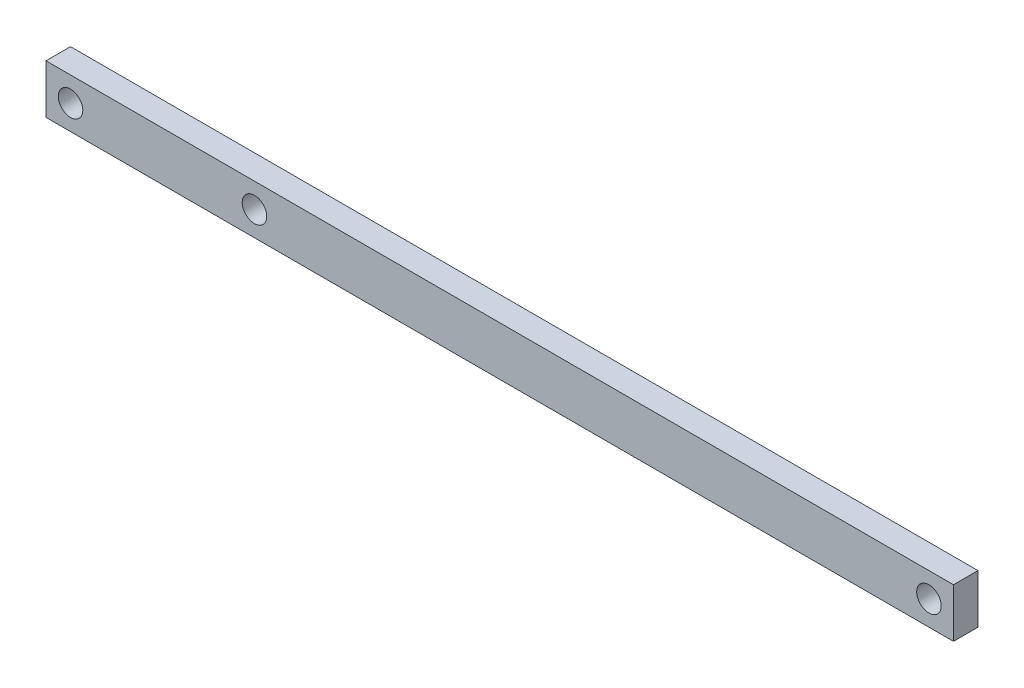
from build123d import *

# Parameters (mm, degrees)
BOSS_EXTRUDE1_DEPTH            = 10
BOSS_EXTRUDE1_DEPTH_BACK       = 10
SKETCH1_W                      = 700
SKETCH1_H                      = 40
SKETCH6_W                      = 20
SKETCH6_H                      = 40
BOSS_EXTRUDE2_DEPTH            = 20
SKETCH7_W                      = 20
SKETCH7_H                      = 40
BOSS_EXTRUDE3_DEPTH            = 20
CUT_EXTRUDE1_REACH             = 372.675
SKETCH2_R                      = 10
CUT_EXTRUDE1_DIRECTION_2_REACH = 372.675
CUT_EXTRUDE3_REACH             = 372.675
SKETCH4_R                      = 10
CUT_EXTRUDE3_DIRECTION_2_REACH = 372.675
CUT_EXTRUDE4_REACH             = 372.675
SKETCH5_R                      = 10
CUT_EXTRUDE4_DIRECTION_2_REACH = 372.675


with BuildPart() as part:
    # Sketch1 → Boss-Extrude1 (new, two sides: drawn at the far end of the back side and taken through both)
    with BuildSketch(Plane.XY.offset(-BOSS_EXTRUDE1_DEPTH_BACK)):
        Rectangle(SKETCH1_W, SKETCH1_H)
    extrude(amount=BOSS_EXTRUDE1_DEPTH + BOSS_EXTRUDE1_DEPTH_BACK)

    # Sketch6 → Boss-Extrude2 (add)
    with BuildSketch(Plane(origin=(350, 0, 0), x_dir=(0, 0, -1), z_dir=(1, 0, 0))):
        Rectangle(SKETCH6_W, SKETCH6_H)
    extrude(amount=BOSS_EXTRUDE2_DEPTH)

    # Sketch7 → Boss-Extrude3 (add)
    with BuildSketch(Plane.ZY.offset(350)):
        Rectangle(SKETCH7_W, SKETCH7_H)
    extrude(amount=BOSS_EXTRUDE3_DEPTH)

    # Cut-Extrude1: up to this face of the body (flat: up to its plane)
    cut_extrude1_end = Plane(part.part.faces().sort_by_distance((0, 0, -10))[0])
    # Sketch2 → Cut-Extrude1 (cut, up to the picked face)
    with BuildSketch(Plane.XY, mode=Mode.PRIVATE) as cut_extrude1_sk1:
        with Locations((350, 0)):
            Circle(SKETCH2_R)
    cut_extrude1_tool1 = split(extrude(cut_extrude1_sk1.sketch, amount=-CUT_EXTRUDE1_REACH, mode=Mode.PRIVATE), bisect_by=cut_extrude1_end, keep=Keep.BOTH, mode=Mode.PRIVATE)
    add(cut_extrude1_tool1.solids().sort_by(Axis((350, 0, 0), (0, 0, -1)))[0], mode=Mode.SUBTRACT)

    # Cut-Extrude1 direction 2: up to this face of the body (flat: up to its plane)
    cut_extrude1_direction_2_end = Plane(part.part.faces().sort_by_distance((0, 0, 10))[0])
    # Sketch2 → Cut-Extrude1 direction 2 (cut, up to the picked face)
    with BuildSketch(Plane.XY, mode=Mode.PRIVATE) as cut_extrude1_direction_2_sk1:
        with Locations((350, 0)):
            Circle(SKETCH2_R)
    cut_extrude1_direction_2_tool1 = split(extrude(cut_extrude1_direction_2_sk1.sketch, amount=CUT_EXTRUDE1_DIRECTION_2_REACH, mode=Mode.PRIVATE), bisect_by=cut_extrude1_direction_2_end, keep=Keep.BOTH, mode=Mode.PRIVATE)
    add(cut_extrude1_direction_2_tool1.solids().sort_by(Axis((350, 0, 0), (0, 0, 1)))[0], mode=Mode.SUBTRACT)

    # Cut-Extrude3: up to this face of the body (flat: up to its plane)
    cut_extrude3_end = Plane(part.part.faces().sort_by_distance((-3.754570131, 0, -10))[0])
    # Sketch4 → Cut-Extrude3 (cut, up to the picked face)
    with BuildSketch(Plane.XY, mode=Mode.PRIVATE) as cut_extrude3_sk1:
        with Locations((-350, 0)):
            Circle(SKETCH4_R)
    cut_extrude3_tool1 = split(extrude(cut_extrude3_sk1.sketch, amount=-CUT_EXTRUDE3_REACH, mode=Mode.PRIVATE), bisect_by=cut_extrude3_end, keep=Keep.BOTH, mode=Mode.PRIVATE)
    add(cut_extrude3_tool1.solids().sort_by(Axis((-350, 0, 0), (0, 0, -1)))[0], mode=Mode.SUBTRACT)

    # Cut-Extrude3 direction 2: up to this face of the body (flat: up to its plane)
    cut_extrude3_direction_2_end = Plane(part.part.faces().sort_by_distance((-3.754570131, 0, 10))[0])
    # Sketch4 → Cut-Extrude3 direction 2 (cut, up to the picked face)
    with BuildSketch(Plane.XY, mode=Mode.PRIVATE) as cut_extrude3_direction_2_sk1:
        with Locations((-350, 0)):
            Circle(SKETCH4_R)
    cut_extrude3_direction_2_tool1 = split(extrude(cut_extrude3_direction_2_sk1.sketch, amount=CUT_EXTRUDE3_DIRECTION_2_REACH, mode=Mode.PRIVATE), bisect_by=cut_extrude3_direction_2_end, keep=Keep.BOTH, mode=Mode.PRIVATE)
    add(cut_extrude3_direction_2_tool1.solids().sort_by(Axis((-350, 0, 0), (0, 0, 1)))[0], mode=Mode.SUBTRACT)

    # Cut-Extrude4: up to this face of the body (flat: up to its plane)
    cut_extrude4_end = Plane(part.part.faces().sort_by_distance((0, 0, -10))[0])
    # Sketch5 → Cut-Extrude4 (cut, up to the picked face)
    with BuildSketch(Plane.XY, mode=Mode.PRIVATE) as cut_extrude4_sk1:
        with Locations((-200, 0)):
            Circle(SKETCH5_R)
    cut_extrude4_tool1 = split(extrude(cut_extrude4_sk1.sketch, amount=-CUT_EXTRUDE4_REACH, mode=Mode.PRIVATE), bisect_by=cut_extrude4_end, keep=Keep.BOTH, mode=Mode.PRIVATE)
    add(cut_extrude4_tool1.solids().sort_by(Axis((-200, 0, 0), (0, 0, -1)))[0], mode=Mode.SUBTRACT)

    # Cut-Extrude4 direction 2: up to this face of the body (flat: up to its plane)
    cut_extrude4_direction_2_end = Plane(part.part.faces().sort_by_distance((0, 0, 10))[0])
    # Sketch5 → Cut-Extrude4 direction 2 (cut, up to the picked face)
    with BuildSketch(Plane.XY, mode=Mode.PRIVATE) as cut_extrude4_direction_2_sk1:
        with Locations((-200, 0)):
            Circle(SKETCH5_R)
    cut_extrude4_direction_2_tool1 = split(extrude(cut_extrude4_direction_2_sk1.sketch, amount=CUT_EXTRUDE4_DIRECTION_2_REACH, mode=Mode.PRIVATE), bisect_by=cut_extrude4_direction_2_end, keep=Keep.BOTH, mode=Mode.PRIVATE)
    add(cut_extrude4_direction_2_tool1.solids().sort_by(Axis((-200, 0, 0), (0, 0, 1)))[0], mode=Mode.SUBTRACT)


solid = part.part
